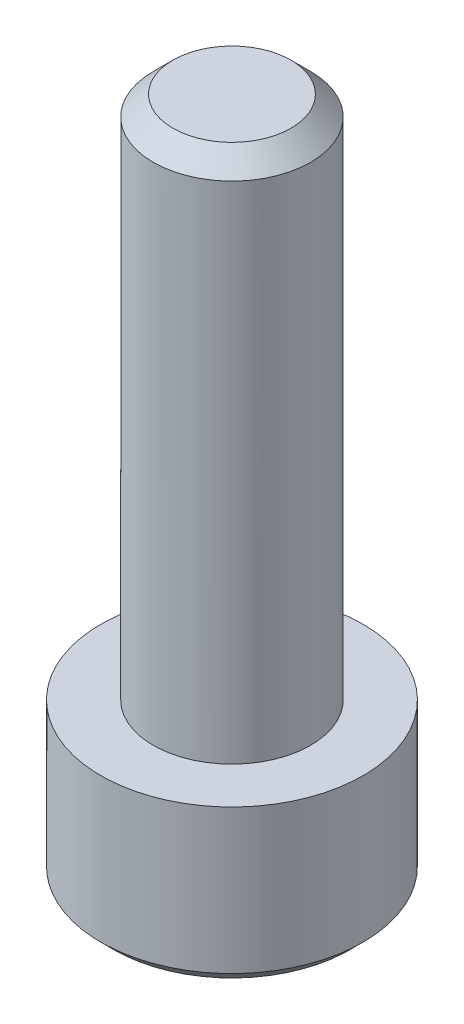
from build123d import *

# Parameters (mm, degrees)
CHANFREIN_FILETAGE_SIZE = 0.75
F_6_PANS_DEPTH          = 5
CHANFREIN_T_TE_SIZE     = 0.5


with BuildPart() as part:
    # Esquisse1 → Base-R_volution (revolve)
    with BuildSketch(Plane.XY, mode=Mode.PRIVATE) as base_r_volution_sk:
        Polygon((0, 0), (-5, 0), (-5, 6), (-3, 6), (-3, 26), (0, 26), align=None)
    revolve(base_r_volution_sk.sketch.rotate(Axis((0, -0.731448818, 0), (0, 1, 0)), 270), axis=Axis((0, -0.731448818, 0), (0, 1, 0)))

    # Chanfrein filetage
    chanfrein_filetage_edges = [part.edges().sort_by_distance(p)[0] for p in [
        (0, 26, 3),
    ]]
    chamfer(chanfrein_filetage_edges, length=CHANFREIN_FILETAGE_SIZE)

    # Esquisse2 → 6 pans (cut)
    with BuildSketch(Plane.XZ):
        Polygon((2.886751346, 0), (1.443375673, 2.5), (-1.443375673, 2.5), (-2.886751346, 0), (-1.443375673, -2.5), (1.443375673, -2.5), align=None)
    extrude(amount=-F_6_PANS_DEPTH, mode=Mode.SUBTRACT)

    # Chanfrein t_te
    chanfrein_t_te_edges = [part.edges().sort_by_distance(p)[0] for p in [
        (0, 0, 5),
    ]]
    chamfer(chanfrein_t_te_edges, length=CHANFREIN_T_TE_SIZE)


solid = part.part
